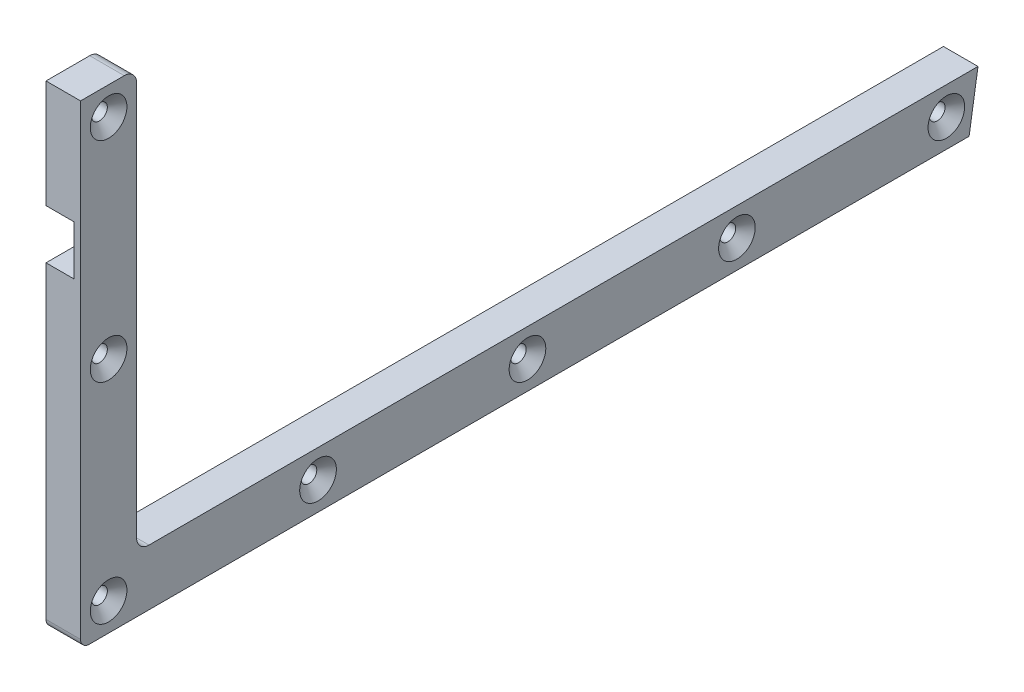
ISO-10303-21;
HEADER;
FILE_DESCRIPTION(('STEP AP214'),'2;1');
FILE_NAME('part.step','',(''),(''),'','','');
FILE_SCHEMA(('AUTOMOTIVE_DESIGN { 1 0 10303 214 1 1 1 1 }'));
ENDSEC;
DATA;
#1=APPLICATION_CONTEXT('core data for automotive mechanical design processes');
#2=APPLICATION_PROTOCOL_DEFINITION('international standard','automotive_design',2000,#1);
#3=PRODUCT_CONTEXT('',#1,'mechanical');
#4=PRODUCT('Part','Part','',(#3));
#5=PRODUCT_RELATED_PRODUCT_CATEGORY('part','',(#4));
#6=PRODUCT_DEFINITION_FORMATION('','',#4);
#7=PRODUCT_DEFINITION_CONTEXT('part definition',#1,'design');
#8=PRODUCT_DEFINITION('design','',#6,#7);
#9=PRODUCT_DEFINITION_SHAPE('','',#8);
#10=(LENGTH_UNIT() NAMED_UNIT(*) SI_UNIT(.MILLI.,.METRE.));
#11=(NAMED_UNIT(*) PLANE_ANGLE_UNIT() SI_UNIT($,.RADIAN.));
#12=(NAMED_UNIT(*) SI_UNIT($,.STERADIAN.) SOLID_ANGLE_UNIT());
#13=UNCERTAINTY_MEASURE_WITH_UNIT(LENGTH_MEASURE(1.E-05),#10,'distance_accuracy_value','');
#14=(GEOMETRIC_REPRESENTATION_CONTEXT(3) GLOBAL_UNCERTAINTY_ASSIGNED_CONTEXT((#13)) GLOBAL_UNIT_ASSIGNED_CONTEXT((#10,
#11,#12)) REPRESENTATION_CONTEXT('',''));
#15=CARTESIAN_POINT('',(0.,0.,0.));
#16=DIRECTION('',(0.,0.,1.));
#17=DIRECTION('',(1.,0.,0.));
#18=AXIS2_PLACEMENT_3D('',#15,#16,#17);
#19=CARTESIAN_POINT('',(0.,-54.3707425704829,5.43537036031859));
#20=DIRECTION('',(1.,0.,0.));
#21=DIRECTION('',(0.,0.,-1.));
#22=AXIS2_PLACEMENT_3D('',#19,#20,#21);
#23=PLANE('',#22);
#24=CARTESIAN_POINT('',(0.,51.9455896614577,0.719038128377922));
#25=DIRECTION('',(1.,0.,0.));
#26=DIRECTION('',(0.,0.,-1.));
#27=AXIS2_PLACEMENT_3D('',#24,#25,#26);
#28=CIRCLE('',#27,1.905);
#29=CARTESIAN_POINT('',(0.,51.9455896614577,-1.18596187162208));
#30=VERTEX_POINT('',#29);
#31=EDGE_CURVE('E265',#30,#30,#28,.T.);
#32=ORIENTED_EDGE('',*,*,#31,.T.);
#33=EDGE_LOOP('',(#32));
#34=FACE_BOUND('',#33,.T.);
#35=DIRECTION('',(0.,1.,0.));
#36=VECTOR('',#35,1.);
#37=CARTESIAN_POINT('',(0.,-39.8544103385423,-6.08096187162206));
#38=LINE('',#37,#36);
#39=CARTESIAN_POINT('',(0.,32.5455896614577,-6.08096187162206));
#40=VERTEX_POINT('',#39);
#41=CARTESIAN_POINT('',(0.,55.7455896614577,-6.08096187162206));
#42=VERTEX_POINT('',#41);
#43=EDGE_CURVE('E168',#40,#42,#38,.T.);
#44=ORIENTED_EDGE('',*,*,#43,.F.);
#45=DIRECTION('',(0.,0.,-1.));
#46=VECTOR('',#45,1.);
#47=CARTESIAN_POINT('',(0.,32.5455896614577,7.51903812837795));
#48=LINE('',#47,#46);
#49=CARTESIAN_POINT('',(0.,32.5455896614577,7.51903812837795));
#50=VERTEX_POINT('',#49);
#51=EDGE_CURVE('E256',#50,#40,#48,.T.);
#52=ORIENTED_EDGE('',*,*,#51,.F.);
#53=DIRECTION('',(0.,-1.,0.));
#54=VECTOR('',#53,1.);
#55=CARTESIAN_POINT('',(0.,58.7455896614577,7.51903812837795));
#56=LINE('',#55,#54);
#57=CARTESIAN_POINT('',(0.,58.7455896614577,7.51903812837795));
#58=VERTEX_POINT('',#57);
#59=EDGE_CURVE('E156',#58,#50,#56,.T.);
#60=ORIENTED_EDGE('',*,*,#59,.F.);
#61=DIRECTION('',(0.,0.,1.));
#62=VECTOR('',#61,1.);
#63=CARTESIAN_POINT('',(0.,58.7455896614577,-3.08096187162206));
#64=LINE('',#63,#62);
#65=CARTESIAN_POINT('',(0.,58.7455896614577,-3.08096187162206));
#66=VERTEX_POINT('',#65);
#67=EDGE_CURVE('E151',#66,#58,#64,.T.);
#68=ORIENTED_EDGE('',*,*,#67,.F.);
#69=CARTESIAN_POINT('',(0.,55.7455896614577,-3.08096187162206));
#70=DIRECTION('',(1.,0.,0.));
#71=DIRECTION('',(0.,0.,-1.));
#72=AXIS2_PLACEMENT_3D('',#69,#70,#71);
#73=CIRCLE('',#72,3.);
#74=EDGE_CURVE('E94',#42,#66,#73,.T.);
#75=ORIENTED_EDGE('',*,*,#74,.F.);
#76=EDGE_LOOP('',(#44,#52,#60,#68,#75));
#77=FACE_BOUND('',#76,.T.);
#78=ADVANCED_FACE('F34',(#34,#77),#23,.F.);
#79=CARTESIAN_POINT('',(8.382,-54.3707425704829,5.43537036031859));
#80=DIRECTION('',(1.,0.,0.));
#81=DIRECTION('',(0.,0.,-1.));
#82=AXIS2_PLACEMENT_3D('',#79,#80,#81);
#83=PLANE('',#82);
#84=CARTESIAN_POINT('',(8.382,-49.6544103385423,-202.480961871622));
#85=DIRECTION('',(1.,0.,0.));
#86=DIRECTION('',(0.,0.,-1.));
#87=AXIS2_PLACEMENT_3D('',#84,#85,#86);
#88=CIRCLE('',#87,4.44499999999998);
#89=CARTESIAN_POINT('',(8.382,-49.6544103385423,-206.925961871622));
#90=VERTEX_POINT('',#89);
#91=EDGE_CURVE('E211',#90,#90,#88,.F.);
#92=ORIENTED_EDGE('',*,*,#91,.T.);
#93=EDGE_LOOP('',(#92));
#94=FACE_BOUND('',#93,.T.);
#95=CARTESIAN_POINT('',(8.382,-49.6544103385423,-151.680961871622));
#96=DIRECTION('',(1.,0.,0.));
#97=DIRECTION('',(0.,0.,-1.));
#98=AXIS2_PLACEMENT_3D('',#95,#96,#97);
#99=CIRCLE('',#98,4.44499999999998);
#100=CARTESIAN_POINT('',(8.382,-49.6544103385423,-156.125961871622));
#101=VERTEX_POINT('',#100);
#102=EDGE_CURVE('E208',#101,#101,#99,.F.);
#103=ORIENTED_EDGE('',*,*,#102,.T.);
#104=EDGE_LOOP('',(#103));
#105=FACE_BOUND('',#104,.T.);
#106=CARTESIAN_POINT('',(8.382,-49.6544103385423,-100.880961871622));
#107=DIRECTION('',(1.,0.,0.));
#108=DIRECTION('',(0.,0.,-1.));
#109=AXIS2_PLACEMENT_3D('',#106,#107,#108);
#110=CIRCLE('',#109,4.445);
#111=CARTESIAN_POINT('',(8.382,-49.6544103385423,-105.325961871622));
#112=VERTEX_POINT('',#111);
#113=EDGE_CURVE('E205',#112,#112,#110,.F.);
#114=ORIENTED_EDGE('',*,*,#113,.T.);
#115=EDGE_LOOP('',(#114));
#116=FACE_BOUND('',#115,.T.);
#117=CARTESIAN_POINT('',(8.382,-49.6544103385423,-50.0809618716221));
#118=DIRECTION('',(1.,0.,0.));
#119=DIRECTION('',(0.,0.,-1.));
#120=AXIS2_PLACEMENT_3D('',#117,#118,#119);
#121=CIRCLE('',#120,4.44499999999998);
#122=CARTESIAN_POINT('',(8.382,-49.6544103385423,-54.5259618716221));
#123=VERTEX_POINT('',#122);
#124=EDGE_CURVE('E202',#123,#123,#121,.F.);
#125=ORIENTED_EDGE('',*,*,#124,.T.);
#126=EDGE_LOOP('',(#125));
#127=FACE_BOUND('',#126,.T.);
#128=CARTESIAN_POINT('',(8.382,-49.6544103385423,0.719038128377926));
#129=DIRECTION('',(1.,0.,0.));
#130=DIRECTION('',(0.,0.,-1.));
#131=AXIS2_PLACEMENT_3D('',#128,#129,#130);
#132=CIRCLE('',#131,4.445);
#133=CARTESIAN_POINT('',(8.382,-49.6544103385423,-3.72596187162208));
#134=VERTEX_POINT('',#133);
#135=EDGE_CURVE('E199',#134,#134,#132,.F.);
#136=ORIENTED_EDGE('',*,*,#135,.T.);
#137=EDGE_LOOP('',(#136));
#138=FACE_BOUND('',#137,.T.);
#139=CARTESIAN_POINT('',(8.382,1.14558966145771,0.719038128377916));
#140=DIRECTION('',(1.,0.,0.));
#141=DIRECTION('',(0.,0.,-1.));
#142=AXIS2_PLACEMENT_3D('',#139,#140,#141);
#143=CIRCLE('',#142,4.44499999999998);
#144=CARTESIAN_POINT('',(8.382,1.14558966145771,-3.72596187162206));
#145=VERTEX_POINT('',#144);
#146=EDGE_CURVE('E196',#145,#145,#143,.F.);
#147=ORIENTED_EDGE('',*,*,#146,.T.);
#148=EDGE_LOOP('',(#147));
#149=FACE_BOUND('',#148,.T.);
#150=CARTESIAN_POINT('',(8.382,51.9455896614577,0.719038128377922));
#151=DIRECTION('',(1.,0.,0.));
#152=DIRECTION('',(0.,0.,-1.));
#153=AXIS2_PLACEMENT_3D('',#150,#151,#152);
#154=CIRCLE('',#153,4.445);
#155=CARTESIAN_POINT('',(8.382,51.9455896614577,-3.72596187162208));
#156=VERTEX_POINT('',#155);
#157=EDGE_CURVE('E193',#156,#156,#154,.F.);
#158=ORIENTED_EDGE('',*,*,#157,.T.);
#159=EDGE_LOOP('',(#158));
#160=FACE_BOUND('',#159,.T.);
#161=DIRECTION('',(0.,0.,1.));
#162=VECTOR('',#161,1.);
#163=CARTESIAN_POINT('',(8.382,58.7455896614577,-3.08096187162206));
#164=LINE('',#163,#162);
#165=CARTESIAN_POINT('',(8.382,58.7455896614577,-3.08096187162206));
#166=VERTEX_POINT('',#165);
#167=CARTESIAN_POINT('',(8.382,58.7455896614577,7.51903812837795));
#168=VERTEX_POINT('',#167);
#169=EDGE_CURVE('E172',#166,#168,#164,.T.);
#170=ORIENTED_EDGE('',*,*,#169,.T.);
#171=DIRECTION('',(0.,-1.,0.));
#172=VECTOR('',#171,1.);
#173=CARTESIAN_POINT('',(8.382,58.7455896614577,7.51903812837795));
#174=LINE('',#173,#172);
#175=CARTESIAN_POINT('',(8.382,-54.3707425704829,7.51903812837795));
#176=VERTEX_POINT('',#175);
#177=EDGE_CURVE('E103',#168,#176,#174,.T.);
#178=ORIENTED_EDGE('',*,*,#177,.T.);
#179=CARTESIAN_POINT('',(8.382,-54.3707425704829,5.43537036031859));
#180=DIRECTION('',(1.,0.,0.));
#181=DIRECTION('',(0.,0.,-1.));
#182=AXIS2_PLACEMENT_3D('',#179,#180,#181);
#183=CIRCLE('',#182,2.08366776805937);
#184=CARTESIAN_POINT('',(8.382,-56.4544103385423,5.43537036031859));
#185=VERTEX_POINT('',#184);
#186=EDGE_CURVE('E287',#176,#185,#183,.T.);
#187=ORIENTED_EDGE('',*,*,#186,.T.);
#188=DIRECTION('',(0.,0.,-1.));
#189=VECTOR('',#188,1.);
#190=CARTESIAN_POINT('',(8.382,-56.4544103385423,5.43537036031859));
#191=LINE('',#190,#189);
#192=CARTESIAN_POINT('',(8.382,-56.4544103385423,-207.999961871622));
#193=VERTEX_POINT('',#192);
#194=EDGE_CURVE('E289',#185,#193,#191,.T.);
#195=ORIENTED_EDGE('',*,*,#194,.T.);
#196=DIRECTION('',(0.,0.987676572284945,-0.156508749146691));
#197=VECTOR('',#196,1.);
#198=CARTESIAN_POINT('',(8.382,-56.4544103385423,-207.999961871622));
#199=LINE('',#198,#197);
#200=CARTESIAN_POINT('',(8.382,-42.8544103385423,-210.155038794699));
#201=VERTEX_POINT('',#200);
#202=EDGE_CURVE('E291',#193,#201,#199,.T.);
#203=ORIENTED_EDGE('',*,*,#202,.T.);
#204=DIRECTION('',(0.,0.,1.));
#205=VECTOR('',#204,1.);
#206=CARTESIAN_POINT('',(8.382,-42.8544103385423,-210.155038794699));
#207=LINE('',#206,#205);
#208=CARTESIAN_POINT('',(8.382,-42.8544103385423,-9.08096187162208));
#209=VERTEX_POINT('',#208);
#210=EDGE_CURVE('E128',#201,#209,#207,.T.);
#211=ORIENTED_EDGE('',*,*,#210,.T.);
#212=CARTESIAN_POINT('',(8.382,-39.8544103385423,-9.08096187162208));
#213=DIRECTION('',(-1.,0.,0.));
#214=DIRECTION('',(0.,0.,1.));
#215=AXIS2_PLACEMENT_3D('',#212,#213,#214);
#216=CIRCLE('',#215,3.00000000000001);
#217=CARTESIAN_POINT('',(8.382,-39.8544103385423,-6.08096187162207));
#218=VERTEX_POINT('',#217);
#219=EDGE_CURVE('E121',#209,#218,#216,.T.);
#220=ORIENTED_EDGE('',*,*,#219,.T.);
#221=DIRECTION('',(0.,1.,0.));
#222=VECTOR('',#221,1.);
#223=CARTESIAN_POINT('',(8.382,-39.8544103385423,-6.08096187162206));
#224=LINE('',#223,#222);
#225=CARTESIAN_POINT('',(8.382,55.7455896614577,-6.08096187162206));
#226=VERTEX_POINT('',#225);
#227=EDGE_CURVE('E125',#218,#226,#224,.T.);
#228=ORIENTED_EDGE('',*,*,#227,.T.);
#229=CARTESIAN_POINT('',(8.382,55.7455896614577,-3.08096187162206));
#230=DIRECTION('',(1.,0.,0.));
#231=DIRECTION('',(0.,0.,-1.));
#232=AXIS2_PLACEMENT_3D('',#229,#230,#231);
#233=CIRCLE('',#232,3.);
#234=EDGE_CURVE('E58',#226,#166,#233,.T.);
#235=ORIENTED_EDGE('',*,*,#234,.T.);
#236=EDGE_LOOP('',(#170,#178,#187,#195,#203,#211,#220,#228,#235));
#237=FACE_BOUND('',#236,.T.);
#238=ADVANCED_FACE('F123',(#94,#105,#116,#127,#138,#149,#160,#237),#83,.T.);
#239=CARTESIAN_POINT('',(0.,20.5455896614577,7.51903812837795));
#240=VERTEX_POINT('',#239);
#241=CARTESIAN_POINT('',(0.,-54.3707425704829,7.51903812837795));
#242=VERTEX_POINT('',#241);
#243=EDGE_CURVE('E154',#240,#242,#56,.T.);
#244=ORIENTED_EDGE('',*,*,#243,.F.);
#245=DIRECTION('',(0.,0.,1.));
#246=VECTOR('',#245,1.);
#247=CARTESIAN_POINT('',(0.,20.5455896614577,7.51903812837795));
#248=LINE('',#247,#246);
#249=CARTESIAN_POINT('',(0.,20.5455896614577,-6.08096187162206));
#250=VERTEX_POINT('',#249);
#251=EDGE_CURVE('E251',#250,#240,#248,.T.);
#252=ORIENTED_EDGE('',*,*,#251,.F.);
#253=CARTESIAN_POINT('',(0.,-39.8544103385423,-6.08096187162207));
#254=VERTEX_POINT('',#253);
#255=EDGE_CURVE('E169',#254,#250,#38,.T.);
#256=ORIENTED_EDGE('',*,*,#255,.F.);
#257=CARTESIAN_POINT('',(0.,-39.8544103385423,-9.08096187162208));
#258=DIRECTION('',(-1.,0.,0.));
#259=DIRECTION('',(0.,0.,1.));
#260=AXIS2_PLACEMENT_3D('',#257,#258,#259);
#261=CIRCLE('',#260,3.00000000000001);
#262=CARTESIAN_POINT('',(0.,-42.8544103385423,-9.08096187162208));
#263=VERTEX_POINT('',#262);
#264=EDGE_CURVE('E137',#263,#254,#261,.T.);
#265=ORIENTED_EDGE('',*,*,#264,.F.);
#266=DIRECTION('',(0.,0.,1.));
#267=VECTOR('',#266,1.);
#268=CARTESIAN_POINT('',(0.,-42.8544103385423,-210.155038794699));
#269=LINE('',#268,#267);
#270=CARTESIAN_POINT('',(0.,-42.8544103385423,-210.155038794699));
#271=VERTEX_POINT('',#270);
#272=EDGE_CURVE('E165',#271,#263,#269,.T.);
#273=ORIENTED_EDGE('',*,*,#272,.F.);
#274=DIRECTION('',(0.,0.987676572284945,-0.156508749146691));
#275=VECTOR('',#274,1.);
#276=CARTESIAN_POINT('',(0.,-56.4544103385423,-207.999961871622));
#277=LINE('',#276,#275);
#278=CARTESIAN_POINT('',(0.,-56.4544103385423,-207.999961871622));
#279=VERTEX_POINT('',#278);
#280=EDGE_CURVE('E163',#279,#271,#277,.T.);
#281=ORIENTED_EDGE('',*,*,#280,.F.);
#282=DIRECTION('',(0.,0.,-1.));
#283=VECTOR('',#282,1.);
#284=CARTESIAN_POINT('',(0.,-56.4544103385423,5.43537036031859));
#285=LINE('',#284,#283);
#286=CARTESIAN_POINT('',(0.,-56.4544103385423,5.43537036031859));
#287=VERTEX_POINT('',#286);
#288=EDGE_CURVE('E161',#287,#279,#285,.T.);
#289=ORIENTED_EDGE('',*,*,#288,.F.);
#290=CARTESIAN_POINT('',(0.,-54.3707425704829,5.43537036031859));
#291=DIRECTION('',(1.,0.,0.));
#292=DIRECTION('',(0.,0.,-1.));
#293=AXIS2_PLACEMENT_3D('',#290,#291,#292);
#294=CIRCLE('',#293,2.08366776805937);
#295=EDGE_CURVE('E159',#242,#287,#294,.T.);
#296=ORIENTED_EDGE('',*,*,#295,.F.);
#297=EDGE_LOOP('',(#244,#252,#256,#265,#273,#281,#289,#296));
#298=FACE_BOUND('',#297,.T.);
#299=CARTESIAN_POINT('',(0.,-49.6544103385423,-151.680961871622));
#300=DIRECTION('',(1.,0.,0.));
#301=DIRECTION('',(0.,0.,-1.));
#302=AXIS2_PLACEMENT_3D('',#299,#300,#301);
#303=CIRCLE('',#302,1.90499999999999);
#304=CARTESIAN_POINT('',(0.,-49.6544103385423,-153.585961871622));
#305=VERTEX_POINT('',#304);
#306=EDGE_CURVE('E155',#305,#305,#303,.T.);
#307=ORIENTED_EDGE('',*,*,#306,.T.);
#308=EDGE_LOOP('',(#307));
#309=FACE_BOUND('',#308,.T.);
#310=CARTESIAN_POINT('',(0.,-49.6544103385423,-50.0809618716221));
#311=DIRECTION('',(1.,0.,0.));
#312=DIRECTION('',(0.,0.,-1.));
#313=AXIS2_PLACEMENT_3D('',#310,#311,#312);
#314=CIRCLE('',#313,1.905);
#315=CARTESIAN_POINT('',(0.,-49.6544103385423,-51.9859618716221));
#316=VERTEX_POINT('',#315);
#317=EDGE_CURVE('E280',#316,#316,#314,.T.);
#318=ORIENTED_EDGE('',*,*,#317,.T.);
#319=EDGE_LOOP('',(#318));
#320=FACE_BOUND('',#319,.T.);
#321=CARTESIAN_POINT('',(0.,-49.6544103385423,-202.480961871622));
#322=DIRECTION('',(1.,0.,0.));
#323=DIRECTION('',(0.,0.,-1.));
#324=AXIS2_PLACEMENT_3D('',#321,#322,#323);
#325=CIRCLE('',#324,1.90499999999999);
#326=CARTESIAN_POINT('',(0.,-49.6544103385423,-204.385961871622));
#327=VERTEX_POINT('',#326);
#328=EDGE_CURVE('E277',#327,#327,#325,.T.);
#329=ORIENTED_EDGE('',*,*,#328,.T.);
#330=EDGE_LOOP('',(#329));
#331=FACE_BOUND('',#330,.T.);
#332=CARTESIAN_POINT('',(0.,-49.6544103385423,-100.880961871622));
#333=DIRECTION('',(1.,0.,0.));
#334=DIRECTION('',(0.,0.,-1.));
#335=AXIS2_PLACEMENT_3D('',#332,#333,#334);
#336=CIRCLE('',#335,1.90500000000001);
#337=CARTESIAN_POINT('',(0.,-49.6544103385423,-102.785961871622));
#338=VERTEX_POINT('',#337);
#339=EDGE_CURVE('E274',#338,#338,#336,.T.);
#340=ORIENTED_EDGE('',*,*,#339,.T.);
#341=EDGE_LOOP('',(#340));
#342=FACE_BOUND('',#341,.T.);
#343=CARTESIAN_POINT('',(0.,-49.6544103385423,0.719038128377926));
#344=DIRECTION('',(1.,0.,0.));
#345=DIRECTION('',(0.,0.,-1.));
#346=AXIS2_PLACEMENT_3D('',#343,#344,#345);
#347=CIRCLE('',#346,1.905);
#348=CARTESIAN_POINT('',(0.,-49.6544103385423,-1.18596187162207));
#349=VERTEX_POINT('',#348);
#350=EDGE_CURVE('E271',#349,#349,#347,.T.);
#351=ORIENTED_EDGE('',*,*,#350,.T.);
#352=EDGE_LOOP('',(#351));
#353=FACE_BOUND('',#352,.T.);
#354=CARTESIAN_POINT('',(0.,1.14558966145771,0.719038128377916));
#355=DIRECTION('',(1.,0.,0.));
#356=DIRECTION('',(0.,0.,-1.));
#357=AXIS2_PLACEMENT_3D('',#354,#355,#356);
#358=CIRCLE('',#357,1.905);
#359=CARTESIAN_POINT('',(0.,1.14558966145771,-1.18596187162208));
#360=VERTEX_POINT('',#359);
#361=EDGE_CURVE('E268',#360,#360,#358,.T.);
#362=ORIENTED_EDGE('',*,*,#361,.T.);
#363=EDGE_LOOP('',(#362));
#364=FACE_BOUND('',#363,.T.);
#365=ADVANCED_FACE('F304',(#298,#309,#320,#331,#342,#353,#364),#23,.F.);
#366=CARTESIAN_POINT('',(8.382,58.7455896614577,-3.08096187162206));
#367=DIRECTION('',(0.,-1.,0.));
#368=DIRECTION('',(0.,0.,-1.));
#369=AXIS2_PLACEMENT_3D('',#366,#367,#368);
#370=PLANE('',#369);
#371=ORIENTED_EDGE('',*,*,#67,.T.);
#372=DIRECTION('',(-1.,0.,0.));
#373=VECTOR('',#372,1.);
#374=CARTESIAN_POINT('',(8.382,58.7455896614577,7.51903812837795));
#375=LINE('',#374,#373);
#376=EDGE_CURVE('E188',#168,#58,#375,.T.);
#377=ORIENTED_EDGE('',*,*,#376,.F.);
#378=ORIENTED_EDGE('',*,*,#169,.F.);
#379=DIRECTION('',(-1.,0.,0.));
#380=VECTOR('',#379,1.);
#381=CARTESIAN_POINT('',(8.382,58.7455896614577,-3.08096187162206));
#382=LINE('',#381,#380);
#383=EDGE_CURVE('E147',#166,#66,#382,.T.);
#384=ORIENTED_EDGE('',*,*,#383,.T.);
#385=EDGE_LOOP('',(#371,#377,#378,#384));
#386=FACE_BOUND('',#385,.T.);
#387=ADVANCED_FACE('F343',(#386),#370,.F.);
#388=CARTESIAN_POINT('',(8.382,58.7455896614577,7.51903812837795));
#389=DIRECTION('',(0.,0.,-1.));
#390=DIRECTION('',(0.,1.,0.));
#391=AXIS2_PLACEMENT_3D('',#388,#389,#390);
#392=PLANE('',#391);
#393=ORIENTED_EDGE('',*,*,#59,.T.);
#394=DIRECTION('',(-1.,0.,0.));
#395=VECTOR('',#394,1.);
#396=CARTESIAN_POINT('',(30.6853629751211,32.5455896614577,7.51903812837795));
#397=LINE('',#396,#395);
#398=CARTESIAN_POINT('',(6.782,32.5455896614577,7.51903812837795));
#399=VERTEX_POINT('',#398);
#400=EDGE_CURVE('E260',#399,#50,#397,.T.);
#401=ORIENTED_EDGE('',*,*,#400,.F.);
#402=DIRECTION('',(0.,1.,0.));
#403=VECTOR('',#402,1.);
#404=CARTESIAN_POINT('',(6.782,32.5455896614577,7.51903812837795));
#405=LINE('',#404,#403);
#406=CARTESIAN_POINT('',(6.782,20.5455896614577,7.51903812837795));
#407=VERTEX_POINT('',#406);
#408=EDGE_CURVE('E247',#407,#399,#405,.T.);
#409=ORIENTED_EDGE('',*,*,#408,.F.);
#410=DIRECTION('',(-1.,0.,0.));
#411=VECTOR('',#410,1.);
#412=CARTESIAN_POINT('',(30.6853629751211,20.5455896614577,7.51903812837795));
#413=LINE('',#412,#411);
#414=EDGE_CURVE('E253',#407,#240,#413,.T.);
#415=ORIENTED_EDGE('',*,*,#414,.T.);
#416=ORIENTED_EDGE('',*,*,#243,.T.);
#417=DIRECTION('',(-1.,0.,0.));
#418=VECTOR('',#417,1.);
#419=CARTESIAN_POINT('',(8.382,-54.3707425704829,7.51903812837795));
#420=LINE('',#419,#418);
#421=EDGE_CURVE('E185',#176,#242,#420,.T.);
#422=ORIENTED_EDGE('',*,*,#421,.F.);
#423=ORIENTED_EDGE('',*,*,#177,.F.);
#424=ORIENTED_EDGE('',*,*,#376,.T.);
#425=EDGE_LOOP('',(#393,#401,#409,#415,#416,#422,#423,#424));
#426=FACE_BOUND('',#425,.T.);
#427=ADVANCED_FACE('F315',(#426),#392,.F.);
#428=CARTESIAN_POINT('',(8.382,-54.3707425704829,5.43537036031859));
#429=DIRECTION('',(-1.,0.,0.));
#430=DIRECTION('',(0.,0.,1.));
#431=AXIS2_PLACEMENT_3D('',#428,#429,#430);
#432=CYLINDRICAL_SURFACE('',#431,2.08366776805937);
#433=ORIENTED_EDGE('',*,*,#295,.T.);
#434=DIRECTION('',(-1.,0.,0.));
#435=VECTOR('',#434,1.);
#436=CARTESIAN_POINT('',(8.382,-56.4544103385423,5.43537036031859));
#437=LINE('',#436,#435);
#438=EDGE_CURVE('E182',#185,#287,#437,.T.);
#439=ORIENTED_EDGE('',*,*,#438,.F.);
#440=ORIENTED_EDGE('',*,*,#186,.F.);
#441=ORIENTED_EDGE('',*,*,#421,.T.);
#442=EDGE_LOOP('',(#433,#439,#440,#441));
#443=FACE_BOUND('',#442,.T.);
#444=ADVANCED_FACE('F320',(#443),#432,.T.);
#445=CARTESIAN_POINT('',(8.382,-56.4544103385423,5.43537036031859));
#446=DIRECTION('',(0.,1.,0.));
#447=DIRECTION('',(0.,0.,1.));
#448=AXIS2_PLACEMENT_3D('',#445,#446,#447);
#449=PLANE('',#448);
#450=ORIENTED_EDGE('',*,*,#288,.T.);
#451=DIRECTION('',(-1.,0.,0.));
#452=VECTOR('',#451,1.);
#453=CARTESIAN_POINT('',(8.382,-56.4544103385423,-207.999961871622));
#454=LINE('',#453,#452);
#455=EDGE_CURVE('E179',#193,#279,#454,.T.);
#456=ORIENTED_EDGE('',*,*,#455,.F.);
#457=ORIENTED_EDGE('',*,*,#194,.F.);
#458=ORIENTED_EDGE('',*,*,#438,.T.);
#459=EDGE_LOOP('',(#450,#456,#457,#458));
#460=FACE_BOUND('',#459,.T.);
#461=ADVANCED_FACE('F323',(#460),#449,.F.);
#462=CARTESIAN_POINT('',(8.382,-56.4544103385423,-207.999961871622));
#463=DIRECTION('',(0.,0.156508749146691,0.987676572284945));
#464=DIRECTION('',(0.,-0.987676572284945,0.156508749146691));
#465=AXIS2_PLACEMENT_3D('',#462,#463,#464);
#466=PLANE('',#465);
#467=ORIENTED_EDGE('',*,*,#280,.T.);
#468=DIRECTION('',(-1.,0.,0.));
#469=VECTOR('',#468,1.);
#470=CARTESIAN_POINT('',(8.382,-42.8544103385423,-210.155038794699));
#471=LINE('',#470,#469);
#472=EDGE_CURVE('E176',#201,#271,#471,.T.);
#473=ORIENTED_EDGE('',*,*,#472,.F.);
#474=ORIENTED_EDGE('',*,*,#202,.F.);
#475=ORIENTED_EDGE('',*,*,#455,.T.);
#476=EDGE_LOOP('',(#467,#473,#474,#475));
#477=FACE_BOUND('',#476,.T.);
#478=ADVANCED_FACE('F297',(#477),#466,.F.);
#479=CARTESIAN_POINT('',(8.382,-42.8544103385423,-210.155038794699));
#480=DIRECTION('',(0.,-1.,0.));
#481=DIRECTION('',(0.,0.,-1.));
#482=AXIS2_PLACEMENT_3D('',#479,#480,#481);
#483=PLANE('',#482);
#484=ORIENTED_EDGE('',*,*,#272,.T.);
#485=DIRECTION('',(-1.,0.,0.));
#486=VECTOR('',#485,1.);
#487=CARTESIAN_POINT('',(8.382,-42.8544103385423,-9.08096187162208));
#488=LINE('',#487,#486);
#489=EDGE_CURVE('E141',#209,#263,#488,.T.);
#490=ORIENTED_EDGE('',*,*,#489,.F.);
#491=ORIENTED_EDGE('',*,*,#210,.F.);
#492=ORIENTED_EDGE('',*,*,#472,.T.);
#493=EDGE_LOOP('',(#484,#490,#491,#492));
#494=FACE_BOUND('',#493,.T.);
#495=ADVANCED_FACE('F301',(#494),#483,.F.);
#496=CARTESIAN_POINT('',(8.382,-39.8544103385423,-9.08096187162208));
#497=DIRECTION('',(-1.,0.,0.));
#498=DIRECTION('',(0.,0.,1.));
#499=AXIS2_PLACEMENT_3D('',#496,#497,#498);
#500=CYLINDRICAL_SURFACE('',#499,3.00000000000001);
#501=ORIENTED_EDGE('',*,*,#264,.T.);
#502=DIRECTION('',(-1.,0.,0.));
#503=VECTOR('',#502,1.);
#504=CARTESIAN_POINT('',(8.382,-39.8544103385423,-6.08096187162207));
#505=LINE('',#504,#503);
#506=EDGE_CURVE('E134',#218,#254,#505,.T.);
#507=ORIENTED_EDGE('',*,*,#506,.F.);
#508=ORIENTED_EDGE('',*,*,#219,.F.);
#509=ORIENTED_EDGE('',*,*,#489,.T.);
#510=EDGE_LOOP('',(#501,#507,#508,#509));
#511=FACE_BOUND('',#510,.T.);
#512=ADVANCED_FACE('F135',(#511),#500,.F.);
#513=CARTESIAN_POINT('',(8.382,-39.8544103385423,-6.08096187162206));
#514=DIRECTION('',(0.,0.,1.));
#515=DIRECTION('',(0.,-1.,0.));
#516=AXIS2_PLACEMENT_3D('',#513,#514,#515);
#517=PLANE('',#516);
#518=DIRECTION('',(0.,1.,0.));
#519=VECTOR('',#518,1.);
#520=CARTESIAN_POINT('',(6.782,-39.8544103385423,-6.08096187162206));
#521=LINE('',#520,#519);
#522=CARTESIAN_POINT('',(6.782,20.5455896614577,-6.08096187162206));
#523=VERTEX_POINT('',#522);
#524=CARTESIAN_POINT('',(6.782,32.5455896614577,-6.08096187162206));
#525=VERTEX_POINT('',#524);
#526=EDGE_CURVE('E42',#523,#525,#521,.T.);
#527=ORIENTED_EDGE('',*,*,#526,.T.);
#528=DIRECTION('',(-1.,0.,0.));
#529=VECTOR('',#528,1.);
#530=CARTESIAN_POINT('',(8.382,32.5455896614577,-6.08096187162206));
#531=LINE('',#530,#529);
#532=EDGE_CURVE('E12',#525,#40,#531,.T.);
#533=ORIENTED_EDGE('',*,*,#532,.T.);
#534=ORIENTED_EDGE('',*,*,#43,.T.);
#535=DIRECTION('',(-1.,0.,0.));
#536=VECTOR('',#535,1.);
#537=CARTESIAN_POINT('',(8.382,55.7455896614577,-6.08096187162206));
#538=LINE('',#537,#536);
#539=EDGE_CURVE('E142',#226,#42,#538,.T.);
#540=ORIENTED_EDGE('',*,*,#539,.F.);
#541=ORIENTED_EDGE('',*,*,#227,.F.);
#542=ORIENTED_EDGE('',*,*,#506,.T.);
#543=ORIENTED_EDGE('',*,*,#255,.T.);
#544=DIRECTION('',(1.,0.,0.));
#545=VECTOR('',#544,1.);
#546=CARTESIAN_POINT('',(8.382,20.5455896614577,-6.08096187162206));
#547=LINE('',#546,#545);
#548=EDGE_CURVE('E232',#250,#523,#547,.T.);
#549=ORIENTED_EDGE('',*,*,#548,.T.);
#550=EDGE_LOOP('',(#527,#533,#534,#540,#541,#542,#543,#549));
#551=FACE_BOUND('',#550,.T.);
#552=ADVANCED_FACE('F145',(#551),#517,.F.);
#553=CARTESIAN_POINT('',(8.382,55.7455896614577,-3.08096187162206));
#554=DIRECTION('',(-1.,0.,0.));
#555=DIRECTION('',(0.,0.,1.));
#556=AXIS2_PLACEMENT_3D('',#553,#554,#555);
#557=CYLINDRICAL_SURFACE('',#556,3.);
#558=ORIENTED_EDGE('',*,*,#74,.T.);
#559=ORIENTED_EDGE('',*,*,#383,.F.);
#560=ORIENTED_EDGE('',*,*,#234,.F.);
#561=ORIENTED_EDGE('',*,*,#539,.T.);
#562=EDGE_LOOP('',(#558,#559,#560,#561));
#563=FACE_BOUND('',#562,.T.);
#564=ADVANCED_FACE('F416',(#563),#557,.T.);
#565=CARTESIAN_POINT('',(8.382,-49.6544103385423,-151.680961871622));
#566=DIRECTION('',(-1.,0.,0.));
#567=DIRECTION('',(0.,0.,1.));
#568=AXIS2_PLACEMENT_3D('',#565,#566,#567);
#569=CYLINDRICAL_SURFACE('',#568,1.90499999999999);
#570=CARTESIAN_POINT('',(6.17401168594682,-49.6544103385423,-151.680961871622));
#571=DIRECTION('',(1.,0.,0.));
#572=DIRECTION('',(0.,0.,-1.));
#573=AXIS2_PLACEMENT_3D('',#570,#571,#572);
#574=CIRCLE('',#573,1.90499999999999);
#575=CARTESIAN_POINT('',(6.17401168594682,-49.6544103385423,-153.585961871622));
#576=VERTEX_POINT('',#575);
#577=EDGE_CURVE('E214',#576,#576,#574,.T.);
#578=ORIENTED_EDGE('',*,*,#577,.T.);
#579=EDGE_LOOP('',(#578));
#580=FACE_BOUND('',#579,.T.);
#581=ORIENTED_EDGE('',*,*,#306,.F.);
#582=EDGE_LOOP('',(#581));
#583=FACE_BOUND('',#582,.T.);
#584=ADVANCED_FACE('F413',(#580,#583),#569,.F.);
#585=CARTESIAN_POINT('',(8.382,-49.6544103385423,-50.0809618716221));
#586=DIRECTION('',(-1.,0.,0.));
#587=DIRECTION('',(0.,0.,1.));
#588=AXIS2_PLACEMENT_3D('',#585,#586,#587);
#589=CYLINDRICAL_SURFACE('',#588,1.905);
#590=CARTESIAN_POINT('',(6.17401168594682,-49.6544103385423,-50.0809618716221));
#591=DIRECTION('',(1.,0.,0.));
#592=DIRECTION('',(0.,0.,-1.));
#593=AXIS2_PLACEMENT_3D('',#590,#591,#592);
#594=CIRCLE('',#593,1.905);
#595=CARTESIAN_POINT('',(6.17401168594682,-49.6544103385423,-51.9859618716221));
#596=VERTEX_POINT('',#595);
#597=EDGE_CURVE('E220',#596,#596,#594,.T.);
#598=ORIENTED_EDGE('',*,*,#597,.T.);
#599=EDGE_LOOP('',(#598));
#600=FACE_BOUND('',#599,.T.);
#601=ORIENTED_EDGE('',*,*,#317,.F.);
#602=EDGE_LOOP('',(#601));
#603=FACE_BOUND('',#602,.T.);
#604=ADVANCED_FACE('F409',(#600,#603),#589,.F.);
#605=CARTESIAN_POINT('',(8.382,-49.6544103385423,-202.480961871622));
#606=DIRECTION('',(-1.,0.,0.));
#607=DIRECTION('',(0.,0.,1.));
#608=AXIS2_PLACEMENT_3D('',#605,#606,#607);
#609=CYLINDRICAL_SURFACE('',#608,1.90499999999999);
#610=CARTESIAN_POINT('',(6.17401168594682,-49.6544103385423,-202.480961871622));
#611=DIRECTION('',(1.,0.,0.));
#612=DIRECTION('',(0.,0.,-1.));
#613=AXIS2_PLACEMENT_3D('',#610,#611,#612);
#614=CIRCLE('',#613,1.90499999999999);
#615=CARTESIAN_POINT('',(6.17401168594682,-49.6544103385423,-204.385961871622));
#616=VERTEX_POINT('',#615);
#617=EDGE_CURVE('E190',#616,#616,#614,.T.);
#618=ORIENTED_EDGE('',*,*,#617,.T.);
#619=EDGE_LOOP('',(#618));
#620=FACE_BOUND('',#619,.T.);
#621=ORIENTED_EDGE('',*,*,#328,.F.);
#622=EDGE_LOOP('',(#621));
#623=FACE_BOUND('',#622,.T.);
#624=ADVANCED_FACE('F405',(#620,#623),#609,.F.);
#625=CARTESIAN_POINT('',(8.382,-49.6544103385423,-100.880961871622));
#626=DIRECTION('',(-1.,0.,0.));
#627=DIRECTION('',(0.,0.,1.));
#628=AXIS2_PLACEMENT_3D('',#625,#626,#627);
#629=CYLINDRICAL_SURFACE('',#628,1.90500000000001);
#630=CARTESIAN_POINT('',(6.17401168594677,-49.6544103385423,-100.880961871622));
#631=DIRECTION('',(1.,0.,0.));
#632=DIRECTION('',(0.,0.,-1.));
#633=AXIS2_PLACEMENT_3D('',#630,#631,#632);
#634=CIRCLE('',#633,1.90500000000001);
#635=CARTESIAN_POINT('',(6.17401168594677,-49.6544103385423,-102.785961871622));
#636=VERTEX_POINT('',#635);
#637=EDGE_CURVE('E217',#636,#636,#634,.T.);
#638=ORIENTED_EDGE('',*,*,#637,.T.);
#639=EDGE_LOOP('',(#638));
#640=FACE_BOUND('',#639,.T.);
#641=ORIENTED_EDGE('',*,*,#339,.F.);
#642=EDGE_LOOP('',(#641));
#643=FACE_BOUND('',#642,.T.);
#644=ADVANCED_FACE('F398',(#640,#643),#629,.F.);
#645=CARTESIAN_POINT('',(8.382,-49.6544103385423,0.719038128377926));
#646=DIRECTION('',(-1.,0.,0.));
#647=DIRECTION('',(0.,0.,1.));
#648=AXIS2_PLACEMENT_3D('',#645,#646,#647);
#649=CYLINDRICAL_SURFACE('',#648,1.905);
#650=CARTESIAN_POINT('',(6.17401168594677,-49.6544103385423,0.719038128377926));
#651=DIRECTION('',(1.,0.,0.));
#652=DIRECTION('',(0.,0.,-1.));
#653=AXIS2_PLACEMENT_3D('',#650,#651,#652);
#654=CIRCLE('',#653,1.905);
#655=CARTESIAN_POINT('',(6.17401168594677,-49.6544103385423,-1.18596187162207));
#656=VERTEX_POINT('',#655);
#657=EDGE_CURVE('E223',#656,#656,#654,.T.);
#658=ORIENTED_EDGE('',*,*,#657,.T.);
#659=EDGE_LOOP('',(#658));
#660=FACE_BOUND('',#659,.T.);
#661=ORIENTED_EDGE('',*,*,#350,.F.);
#662=EDGE_LOOP('',(#661));
#663=FACE_BOUND('',#662,.T.);
#664=ADVANCED_FACE('F388',(#660,#663),#649,.F.);
#665=CARTESIAN_POINT('',(8.382,1.14558966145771,0.719038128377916));
#666=DIRECTION('',(-1.,0.,0.));
#667=DIRECTION('',(0.,0.,1.));
#668=AXIS2_PLACEMENT_3D('',#665,#666,#667);
#669=CYLINDRICAL_SURFACE('',#668,1.905);
#670=CARTESIAN_POINT('',(6.17401168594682,1.14558966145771,0.719038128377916));
#671=DIRECTION('',(1.,0.,0.));
#672=DIRECTION('',(0.,0.,-1.));
#673=AXIS2_PLACEMENT_3D('',#670,#671,#672);
#674=CIRCLE('',#673,1.905);
#675=CARTESIAN_POINT('',(6.17401168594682,1.14558966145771,-1.18596187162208));
#676=VERTEX_POINT('',#675);
#677=EDGE_CURVE('E226',#676,#676,#674,.T.);
#678=ORIENTED_EDGE('',*,*,#677,.T.);
#679=EDGE_LOOP('',(#678));
#680=FACE_BOUND('',#679,.T.);
#681=ORIENTED_EDGE('',*,*,#361,.F.);
#682=EDGE_LOOP('',(#681));
#683=FACE_BOUND('',#682,.T.);
#684=ADVANCED_FACE('F385',(#680,#683),#669,.F.);
#685=CARTESIAN_POINT('',(8.382,51.9455896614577,0.719038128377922));
#686=DIRECTION('',(-1.,0.,0.));
#687=DIRECTION('',(0.,0.,1.));
#688=AXIS2_PLACEMENT_3D('',#685,#686,#687);
#689=CYLINDRICAL_SURFACE('',#688,1.905);
#690=CARTESIAN_POINT('',(6.17401168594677,51.9455896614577,0.719038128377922));
#691=DIRECTION('',(1.,0.,0.));
#692=DIRECTION('',(0.,0.,-1.));
#693=AXIS2_PLACEMENT_3D('',#690,#691,#692);
#694=CIRCLE('',#693,1.905);
#695=CARTESIAN_POINT('',(6.17401168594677,51.9455896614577,-1.18596187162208));
#696=VERTEX_POINT('',#695);
#697=EDGE_CURVE('E229',#696,#696,#694,.T.);
#698=ORIENTED_EDGE('',*,*,#697,.T.);
#699=EDGE_LOOP('',(#698));
#700=FACE_BOUND('',#699,.T.);
#701=ORIENTED_EDGE('',*,*,#31,.F.);
#702=EDGE_LOOP('',(#701));
#703=FACE_BOUND('',#702,.T.);
#704=ADVANCED_FACE('F358',(#700,#703),#689,.F.);
#705=CARTESIAN_POINT('',(6.17401168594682,-49.6544103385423,-202.480961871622));
#706=DIRECTION('',(1.,0.,0.));
#707=DIRECTION('',(0.,0.,-1.));
#708=AXIS2_PLACEMENT_3D('',#705,#706,#707);
#709=CONICAL_SURFACE('',#708,1.90499999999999,0.855211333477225);
#710=ORIENTED_EDGE('',*,*,#91,.F.);
#711=EDGE_LOOP('',(#710));
#712=FACE_BOUND('',#711,.T.);
#713=ORIENTED_EDGE('',*,*,#617,.F.);
#714=EDGE_LOOP('',(#713));
#715=FACE_BOUND('',#714,.T.);
#716=ADVANCED_FACE('F354',(#712,#715),#709,.F.);
#717=CARTESIAN_POINT('',(6.17401168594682,-49.6544103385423,-151.680961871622));
#718=DIRECTION('',(1.,0.,0.));
#719=DIRECTION('',(0.,0.,-1.));
#720=AXIS2_PLACEMENT_3D('',#717,#718,#719);
#721=CONICAL_SURFACE('',#720,1.90499999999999,0.855211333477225);
#722=ORIENTED_EDGE('',*,*,#102,.F.);
#723=EDGE_LOOP('',(#722));
#724=FACE_BOUND('',#723,.T.);
#725=ORIENTED_EDGE('',*,*,#577,.F.);
#726=EDGE_LOOP('',(#725));
#727=FACE_BOUND('',#726,.T.);
#728=ADVANCED_FACE('F357',(#724,#727),#721,.F.);
#729=CARTESIAN_POINT('',(6.17401168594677,-49.6544103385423,-100.880961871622));
#730=DIRECTION('',(1.,0.,0.));
#731=DIRECTION('',(0.,0.,-1.));
#732=AXIS2_PLACEMENT_3D('',#729,#730,#731);
#733=CONICAL_SURFACE('',#732,1.90500000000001,0.855211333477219);
#734=ORIENTED_EDGE('',*,*,#113,.F.);
#735=EDGE_LOOP('',(#734));
#736=FACE_BOUND('',#735,.T.);
#737=ORIENTED_EDGE('',*,*,#637,.F.);
#738=EDGE_LOOP('',(#737));
#739=FACE_BOUND('',#738,.T.);
#740=ADVANCED_FACE('F362',(#736,#739),#733,.F.);
#741=CARTESIAN_POINT('',(6.17401168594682,-49.6544103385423,-50.0809618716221));
#742=DIRECTION('',(1.,0.,0.));
#743=DIRECTION('',(0.,0.,-1.));
#744=AXIS2_PLACEMENT_3D('',#741,#742,#743);
#745=CONICAL_SURFACE('',#744,1.905,0.855211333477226);
#746=ORIENTED_EDGE('',*,*,#124,.F.);
#747=EDGE_LOOP('',(#746));
#748=FACE_BOUND('',#747,.T.);
#749=ORIENTED_EDGE('',*,*,#597,.F.);
#750=EDGE_LOOP('',(#749));
#751=FACE_BOUND('',#750,.T.);
#752=ADVANCED_FACE('F366',(#748,#751),#745,.F.);
#753=CARTESIAN_POINT('',(6.17401168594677,-49.6544103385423,0.719038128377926));
#754=DIRECTION('',(1.,0.,0.));
#755=DIRECTION('',(0.,0.,-1.));
#756=AXIS2_PLACEMENT_3D('',#753,#754,#755);
#757=CONICAL_SURFACE('',#756,1.905,0.855211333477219);
#758=ORIENTED_EDGE('',*,*,#135,.F.);
#759=EDGE_LOOP('',(#758));
#760=FACE_BOUND('',#759,.T.);
#761=ORIENTED_EDGE('',*,*,#657,.F.);
#762=EDGE_LOOP('',(#761));
#763=FACE_BOUND('',#762,.T.);
#764=ADVANCED_FACE('F370',(#760,#763),#757,.F.);
#765=CARTESIAN_POINT('',(6.17401168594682,1.14558966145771,0.719038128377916));
#766=DIRECTION('',(1.,0.,0.));
#767=DIRECTION('',(0.,0.,-1.));
#768=AXIS2_PLACEMENT_3D('',#765,#766,#767);
#769=CONICAL_SURFACE('',#768,1.905,0.855211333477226);
#770=ORIENTED_EDGE('',*,*,#146,.F.);
#771=EDGE_LOOP('',(#770));
#772=FACE_BOUND('',#771,.T.);
#773=ORIENTED_EDGE('',*,*,#677,.F.);
#774=EDGE_LOOP('',(#773));
#775=FACE_BOUND('',#774,.T.);
#776=ADVANCED_FACE('F373',(#772,#775),#769,.F.);
#777=CARTESIAN_POINT('',(6.17401168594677,51.9455896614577,0.719038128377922));
#778=DIRECTION('',(1.,0.,0.));
#779=DIRECTION('',(0.,0.,-1.));
#780=AXIS2_PLACEMENT_3D('',#777,#778,#779);
#781=CONICAL_SURFACE('',#780,1.905,0.855211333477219);
#782=ORIENTED_EDGE('',*,*,#157,.F.);
#783=EDGE_LOOP('',(#782));
#784=FACE_BOUND('',#783,.T.);
#785=ORIENTED_EDGE('',*,*,#697,.F.);
#786=EDGE_LOOP('',(#785));
#787=FACE_BOUND('',#786,.T.);
#788=ADVANCED_FACE('F36',(#784,#787),#781,.F.);
#789=CARTESIAN_POINT('',(6.782,-54.3707425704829,5.43537036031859));
#790=DIRECTION('',(1.,0.,0.));
#791=DIRECTION('',(0.,0.,-1.));
#792=AXIS2_PLACEMENT_3D('',#789,#790,#791);
#793=PLANE('',#792);
#794=DIRECTION('',(0.,0.,1.));
#795=VECTOR('',#794,1.);
#796=CARTESIAN_POINT('',(6.782,20.5455896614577,7.51903812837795));
#797=LINE('',#796,#795);
#798=EDGE_CURVE('E49',#523,#407,#797,.T.);
#799=ORIENTED_EDGE('',*,*,#798,.T.);
#800=ORIENTED_EDGE('',*,*,#408,.T.);
#801=DIRECTION('',(0.,0.,-1.));
#802=VECTOR('',#801,1.);
#803=CARTESIAN_POINT('',(6.782,32.5455896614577,7.51903812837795));
#804=LINE('',#803,#802);
#805=EDGE_CURVE('E244',#399,#525,#804,.T.);
#806=ORIENTED_EDGE('',*,*,#805,.T.);
#807=ORIENTED_EDGE('',*,*,#526,.F.);
#808=EDGE_LOOP('',(#799,#800,#806,#807));
#809=FACE_BOUND('',#808,.T.);
#810=ADVANCED_FACE('F240',(#809),#793,.F.);
#811=CARTESIAN_POINT('',(30.6853629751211,32.5455896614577,7.51903812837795));
#812=DIRECTION('',(0.,1.,0.));
#813=DIRECTION('',(0.,0.,1.));
#814=AXIS2_PLACEMENT_3D('',#811,#812,#813);
#815=PLANE('',#814);
#816=ORIENTED_EDGE('',*,*,#805,.F.);
#817=ORIENTED_EDGE('',*,*,#400,.T.);
#818=ORIENTED_EDGE('',*,*,#51,.T.);
#819=ORIENTED_EDGE('',*,*,#532,.F.);
#820=EDGE_LOOP('',(#816,#817,#818,#819));
#821=FACE_BOUND('',#820,.T.);
#822=ADVANCED_FACE('F470',(#821),#815,.F.);
#823=CARTESIAN_POINT('',(30.6853629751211,20.5455896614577,7.51903812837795));
#824=DIRECTION('',(0.,-1.,0.));
#825=DIRECTION('',(0.,0.,-1.));
#826=AXIS2_PLACEMENT_3D('',#823,#824,#825);
#827=PLANE('',#826);
#828=ORIENTED_EDGE('',*,*,#251,.T.);
#829=ORIENTED_EDGE('',*,*,#414,.F.);
#830=ORIENTED_EDGE('',*,*,#798,.F.);
#831=ORIENTED_EDGE('',*,*,#548,.F.);
#832=EDGE_LOOP('',(#828,#829,#830,#831));
#833=FACE_BOUND('',#832,.T.);
#834=ADVANCED_FACE('F314',(#833),#827,.F.);
#835=CLOSED_SHELL('',(#78,#238,#365,#387,#427,#444,#461,#478,#495,#512,#552,#564,#584,#604,#624,
#644,#664,#684,#704,#716,#728,#740,#752,#764,#776,#788,#810,#822,#834));
#836=MANIFOLD_SOLID_BREP('B2',#835);
#837=ADVANCED_BREP_SHAPE_REPRESENTATION('',(#18,#836),#14);
#838=SHAPE_DEFINITION_REPRESENTATION(#9,#837);
ENDSEC;
END-ISO-10303-21;
